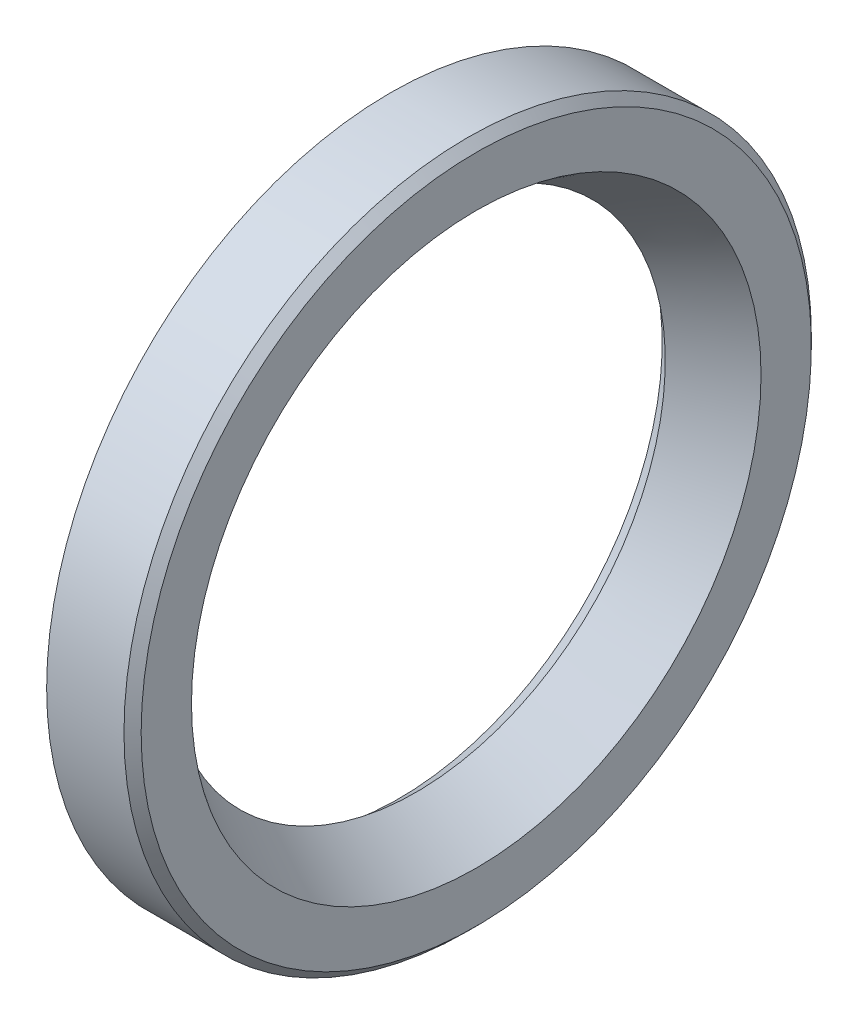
ISO-10303-21;
HEADER;
FILE_DESCRIPTION(('STEP AP214'),'2;1');
FILE_NAME('part.step','',(''),(''),'','','');
FILE_SCHEMA(('AUTOMOTIVE_DESIGN { 1 0 10303 214 1 1 1 1 }'));
ENDSEC;
DATA;
#1=APPLICATION_CONTEXT('core data for automotive mechanical design processes');
#2=APPLICATION_PROTOCOL_DEFINITION('international standard','automotive_design',2000,#1);
#3=PRODUCT_CONTEXT('',#1,'mechanical');
#4=PRODUCT('Part','Part','',(#3));
#5=PRODUCT_RELATED_PRODUCT_CATEGORY('part','',(#4));
#6=PRODUCT_DEFINITION_FORMATION('','',#4);
#7=PRODUCT_DEFINITION_CONTEXT('part definition',#1,'design');
#8=PRODUCT_DEFINITION('design','',#6,#7);
#9=PRODUCT_DEFINITION_SHAPE('','',#8);
#10=(LENGTH_UNIT() NAMED_UNIT(*) SI_UNIT(.MILLI.,.METRE.));
#11=(NAMED_UNIT(*) PLANE_ANGLE_UNIT() SI_UNIT($,.RADIAN.));
#12=(NAMED_UNIT(*) SI_UNIT($,.STERADIAN.) SOLID_ANGLE_UNIT());
#13=UNCERTAINTY_MEASURE_WITH_UNIT(LENGTH_MEASURE(1.E-05),#10,'distance_accuracy_value','');
#14=(GEOMETRIC_REPRESENTATION_CONTEXT(3) GLOBAL_UNCERTAINTY_ASSIGNED_CONTEXT((#13)) GLOBAL_UNIT_ASSIGNED_CONTEXT((#10,
#11,#12)) REPRESENTATION_CONTEXT('',''));
#15=CARTESIAN_POINT('',(0.,0.,0.));
#16=DIRECTION('',(0.,0.,1.));
#17=DIRECTION('',(1.,0.,0.));
#18=AXIS2_PLACEMENT_3D('',#15,#16,#17);
#19=CARTESIAN_POINT('',(5.66666666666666,0.,0.));
#20=DIRECTION('',(-1.,0.,0.));
#21=DIRECTION('',(0.,0.,1.));
#22=AXIS2_PLACEMENT_3D('',#19,#20,#21);
#23=TOROIDAL_SURFACE('',#22,37.2222222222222,1.);
#24=CARTESIAN_POINT('',(6.66666666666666,0.,0.));
#25=DIRECTION('',(-1.,0.,0.));
#26=DIRECTION('',(0.,0.,1.));
#27=AXIS2_PLACEMENT_3D('',#24,#25,#26);
#28=CIRCLE('',#27,37.2222222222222);
#29=CARTESIAN_POINT('',(6.66666666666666,0.,37.2222222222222));
#30=VERTEX_POINT('',#29);
#31=EDGE_CURVE('E10',#30,#30,#28,.T.);
#32=ORIENTED_EDGE('',*,*,#31,.F.);
#33=EDGE_LOOP('',(#32));
#34=FACE_BOUND('',#33,.T.);
#35=CARTESIAN_POINT('',(5.66666666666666,0.,0.));
#36=DIRECTION('',(-1.,0.,0.));
#37=DIRECTION('',(0.,0.,1.));
#38=AXIS2_PLACEMENT_3D('',#35,#36,#37);
#39=CIRCLE('',#38,38.2222222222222);
#40=CARTESIAN_POINT('',(5.66666666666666,0.,38.2222222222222));
#41=VERTEX_POINT('',#40);
#42=EDGE_CURVE('E76',#41,#41,#39,.T.);
#43=ORIENTED_EDGE('',*,*,#42,.T.);
#44=EDGE_LOOP('',(#43));
#45=FACE_BOUND('',#44,.T.);
#46=ADVANCED_FACE('F30',(#34,#45),#23,.F.);
#47=CARTESIAN_POINT('',(6.66666666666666,37.2222222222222,0.));
#48=DIRECTION('',(1.,0.,0.));
#49=DIRECTION('',(0.,0.,-1.));
#50=AXIS2_PLACEMENT_3D('',#47,#48,#49);
#51=PLANE('',#50);
#52=CARTESIAN_POINT('',(6.66666666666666,0.,0.));
#53=DIRECTION('',(-1.,0.,0.));
#54=DIRECTION('',(0.,0.,1.));
#55=AXIS2_PLACEMENT_3D('',#52,#53,#54);
#56=CIRCLE('',#55,33.1428571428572);
#57=CARTESIAN_POINT('',(6.66666666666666,0.,33.1428571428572));
#58=VERTEX_POINT('',#57);
#59=EDGE_CURVE('E36',#58,#58,#56,.T.);
#60=ORIENTED_EDGE('',*,*,#59,.F.);
#61=EDGE_LOOP('',(#60));
#62=FACE_BOUND('',#61,.T.);
#63=ORIENTED_EDGE('',*,*,#31,.T.);
#64=EDGE_LOOP('',(#63));
#65=FACE_BOUND('',#64,.T.);
#66=ADVANCED_FACE('F149',(#62,#65),#51,.F.);
#67=CARTESIAN_POINT('',(5.66666666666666,0.,0.));
#68=DIRECTION('',(-1.,0.,0.));
#69=DIRECTION('',(0.,0.,1.));
#70=AXIS2_PLACEMENT_3D('',#67,#68,#69);
#71=TOROIDAL_SURFACE('',#70,33.1428571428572,1.);
#72=CARTESIAN_POINT('',(5.66666666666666,0.,0.));
#73=DIRECTION('',(-1.,0.,0.));
#74=DIRECTION('',(0.,0.,1.));
#75=AXIS2_PLACEMENT_3D('',#72,#73,#74);
#76=CIRCLE('',#75,32.1428571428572);
#77=CARTESIAN_POINT('',(5.66666666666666,0.,32.1428571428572));
#78=VERTEX_POINT('',#77);
#79=EDGE_CURVE('E40',#78,#78,#76,.T.);
#80=ORIENTED_EDGE('',*,*,#79,.F.);
#81=EDGE_LOOP('',(#80));
#82=FACE_BOUND('',#81,.T.);
#83=ORIENTED_EDGE('',*,*,#59,.T.);
#84=EDGE_LOOP('',(#83));
#85=FACE_BOUND('',#84,.T.);
#86=ADVANCED_FACE('F144',(#82,#85),#71,.F.);
#87=CARTESIAN_POINT('',(-10.,0.,0.));
#88=DIRECTION('',(-1.,0.,0.));
#89=DIRECTION('',(0.,0.,1.));
#90=AXIS2_PLACEMENT_3D('',#87,#88,#89);
#91=CYLINDRICAL_SURFACE('',#90,32.1428571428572);
#92=CARTESIAN_POINT('',(3.,0.,0.));
#93=DIRECTION('',(-1.,0.,0.));
#94=DIRECTION('',(0.,0.,1.));
#95=AXIS2_PLACEMENT_3D('',#92,#93,#94);
#96=CIRCLE('',#95,32.1428571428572);
#97=CARTESIAN_POINT('',(3.,0.,32.1428571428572));
#98=VERTEX_POINT('',#97);
#99=EDGE_CURVE('E44',#98,#98,#96,.T.);
#100=ORIENTED_EDGE('',*,*,#99,.F.);
#101=EDGE_LOOP('',(#100));
#102=FACE_BOUND('',#101,.T.);
#103=ORIENTED_EDGE('',*,*,#79,.T.);
#104=EDGE_LOOP('',(#103));
#105=FACE_BOUND('',#104,.T.);
#106=ADVANCED_FACE('F138',(#102,#105),#91,.T.);
#107=CARTESIAN_POINT('',(3.,0.,0.));
#108=DIRECTION('',(-1.,0.,0.));
#109=DIRECTION('',(0.,0.,1.));
#110=AXIS2_PLACEMENT_3D('',#107,#108,#109);
#111=TOROIDAL_SURFACE('',#110,33.1428571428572,1.);
#112=CARTESIAN_POINT('',(2.,0.,0.));
#113=DIRECTION('',(-1.,0.,0.));
#114=DIRECTION('',(0.,0.,1.));
#115=AXIS2_PLACEMENT_3D('',#112,#113,#114);
#116=CIRCLE('',#115,33.1428571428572);
#117=CARTESIAN_POINT('',(2.,0.,33.1428571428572));
#118=VERTEX_POINT('',#117);
#119=EDGE_CURVE('E49',#118,#118,#116,.T.);
#120=ORIENTED_EDGE('',*,*,#119,.F.);
#121=EDGE_LOOP('',(#120));
#122=FACE_BOUND('',#121,.T.);
#123=ORIENTED_EDGE('',*,*,#99,.T.);
#124=EDGE_LOOP('',(#123));
#125=FACE_BOUND('',#124,.T.);
#126=ADVANCED_FACE('F132',(#122,#125),#111,.T.);
#127=CARTESIAN_POINT('',(-10.,0.,0.));
#128=DIRECTION('',(-1.,0.,0.));
#129=DIRECTION('',(0.,0.,1.));
#130=AXIS2_PLACEMENT_3D('',#127,#128,#129);
#131=CYLINDRICAL_SURFACE('',#130,33.1428571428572);
#132=CARTESIAN_POINT('',(0.999999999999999,0.,0.));
#133=DIRECTION('',(-1.,0.,0.));
#134=DIRECTION('',(0.,0.,1.));
#135=AXIS2_PLACEMENT_3D('',#132,#133,#134);
#136=CIRCLE('',#135,33.1428571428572);
#137=CARTESIAN_POINT('',(0.999999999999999,0.,33.1428571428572));
#138=VERTEX_POINT('',#137);
#139=EDGE_CURVE('E52',#138,#138,#136,.T.);
#140=ORIENTED_EDGE('',*,*,#139,.F.);
#141=EDGE_LOOP('',(#140));
#142=FACE_BOUND('',#141,.T.);
#143=ORIENTED_EDGE('',*,*,#119,.T.);
#144=EDGE_LOOP('',(#143));
#145=FACE_BOUND('',#144,.T.);
#146=ADVANCED_FACE('F126',(#142,#145),#131,.T.);
#147=CARTESIAN_POINT('',(1.,33.1428571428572,0.));
#148=DIRECTION('',(1.,0.,0.));
#149=DIRECTION('',(0.,0.,-1.));
#150=AXIS2_PLACEMENT_3D('',#147,#148,#149);
#151=PLANE('',#150);
#152=CARTESIAN_POINT('',(0.999999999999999,0.,0.));
#153=DIRECTION('',(-1.,0.,0.));
#154=DIRECTION('',(0.,0.,1.));
#155=AXIS2_PLACEMENT_3D('',#152,#153,#154);
#156=CIRCLE('',#155,30.6417311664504);
#157=CARTESIAN_POINT('',(0.999999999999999,0.,30.6417311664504));
#158=VERTEX_POINT('',#157);
#159=EDGE_CURVE('E55',#158,#158,#156,.T.);
#160=ORIENTED_EDGE('',*,*,#159,.F.);
#161=EDGE_LOOP('',(#160));
#162=FACE_BOUND('',#161,.T.);
#163=ORIENTED_EDGE('',*,*,#139,.T.);
#164=EDGE_LOOP('',(#163));
#165=FACE_BOUND('',#164,.T.);
#166=ADVANCED_FACE('F120',(#162,#165),#151,.F.);
#167=CARTESIAN_POINT('',(0.999999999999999,0.,0.));
#168=DIRECTION('',(-1.,0.,0.));
#169=DIRECTION('',(0.,0.,1.));
#170=AXIS2_PLACEMENT_3D('',#167,#168,#169);
#171=CONICAL_SURFACE('',#170,30.6417311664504,0.687334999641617);
#172=CARTESIAN_POINT('',(3.,0.,0.));
#173=DIRECTION('',(-1.,0.,0.));
#174=DIRECTION('',(0.,0.,1.));
#175=AXIS2_PLACEMENT_3D('',#172,#173,#174);
#176=CIRCLE('',#175,29.);
#177=CARTESIAN_POINT('',(3.,0.,29.));
#178=VERTEX_POINT('',#177);
#179=EDGE_CURVE('E58',#178,#178,#176,.T.);
#180=ORIENTED_EDGE('',*,*,#179,.F.);
#181=EDGE_LOOP('',(#180));
#182=FACE_BOUND('',#181,.T.);
#183=ORIENTED_EDGE('',*,*,#159,.T.);
#184=EDGE_LOOP('',(#183));
#185=FACE_BOUND('',#184,.T.);
#186=ADVANCED_FACE('F114',(#182,#185),#171,.F.);
#187=CARTESIAN_POINT('',(3.,0.,0.));
#188=DIRECTION('',(1.,0.,0.));
#189=DIRECTION('',(0.,0.,-1.));
#190=AXIS2_PLACEMENT_3D('',#187,#188,#189);
#191=CONICAL_SURFACE('',#190,29.,0.534395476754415);
#192=CARTESIAN_POINT('',(10.,0.,0.));
#193=DIRECTION('',(-1.,0.,0.));
#194=DIRECTION('',(0.,0.,1.));
#195=AXIS2_PLACEMENT_3D('',#192,#193,#194);
#196=CIRCLE('',#195,33.1428571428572);
#197=CARTESIAN_POINT('',(10.,0.,33.1428571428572));
#198=VERTEX_POINT('',#197);
#199=EDGE_CURVE('E61',#198,#198,#196,.T.);
#200=ORIENTED_EDGE('',*,*,#199,.F.);
#201=EDGE_LOOP('',(#200));
#202=FACE_BOUND('',#201,.T.);
#203=ORIENTED_EDGE('',*,*,#179,.T.);
#204=EDGE_LOOP('',(#203));
#205=FACE_BOUND('',#204,.T.);
#206=ADVANCED_FACE('F108',(#202,#205),#191,.F.);
#207=CARTESIAN_POINT('',(9.99999999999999,33.1428571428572,0.));
#208=DIRECTION('',(-1.,0.,0.));
#209=DIRECTION('',(0.,0.,1.));
#210=AXIS2_PLACEMENT_3D('',#207,#208,#209);
#211=PLANE('',#210);
#212=CARTESIAN_POINT('',(9.99999999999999,0.,0.));
#213=DIRECTION('',(-1.,0.,0.));
#214=DIRECTION('',(0.,0.,1.));
#215=AXIS2_PLACEMENT_3D('',#212,#213,#214);
#216=CIRCLE('',#215,39.);
#217=CARTESIAN_POINT('',(9.99999999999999,0.,39.));
#218=VERTEX_POINT('',#217);
#219=EDGE_CURVE('E64',#218,#218,#216,.T.);
#220=ORIENTED_EDGE('',*,*,#219,.F.);
#221=EDGE_LOOP('',(#220));
#222=FACE_BOUND('',#221,.T.);
#223=ORIENTED_EDGE('',*,*,#199,.T.);
#224=EDGE_LOOP('',(#223));
#225=FACE_BOUND('',#224,.T.);
#226=ADVANCED_FACE('F102',(#222,#225),#211,.F.);
#227=CARTESIAN_POINT('',(9.99999999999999,0.,0.));
#228=DIRECTION('',(-1.,0.,0.));
#229=DIRECTION('',(0.,0.,1.));
#230=AXIS2_PLACEMENT_3D('',#227,#228,#229);
#231=CONICAL_SURFACE('',#230,39.,0.78539816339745);
#232=CARTESIAN_POINT('',(9.,0.,0.));
#233=DIRECTION('',(-1.,0.,0.));
#234=DIRECTION('',(0.,0.,1.));
#235=AXIS2_PLACEMENT_3D('',#232,#233,#234);
#236=CIRCLE('',#235,40.);
#237=CARTESIAN_POINT('',(9.,0.,40.));
#238=VERTEX_POINT('',#237);
#239=EDGE_CURVE('E67',#238,#238,#236,.T.);
#240=ORIENTED_EDGE('',*,*,#239,.F.);
#241=EDGE_LOOP('',(#240));
#242=FACE_BOUND('',#241,.T.);
#243=ORIENTED_EDGE('',*,*,#219,.T.);
#244=EDGE_LOOP('',(#243));
#245=FACE_BOUND('',#244,.T.);
#246=ADVANCED_FACE('F96',(#242,#245),#231,.T.);
#247=CARTESIAN_POINT('',(-10.,0.,0.));
#248=DIRECTION('',(-1.,0.,0.));
#249=DIRECTION('',(0.,0.,1.));
#250=AXIS2_PLACEMENT_3D('',#247,#248,#249);
#251=CYLINDRICAL_SURFACE('',#250,40.);
#252=CARTESIAN_POINT('',(0.,0.,0.));
#253=DIRECTION('',(-1.,0.,0.));
#254=DIRECTION('',(0.,0.,1.));
#255=AXIS2_PLACEMENT_3D('',#252,#253,#254);
#256=CIRCLE('',#255,40.);
#257=CARTESIAN_POINT('',(0.,0.,40.));
#258=VERTEX_POINT('',#257);
#259=EDGE_CURVE('E70',#258,#258,#256,.T.);
#260=ORIENTED_EDGE('',*,*,#259,.F.);
#261=EDGE_LOOP('',(#260));
#262=FACE_BOUND('',#261,.T.);
#263=ORIENTED_EDGE('',*,*,#239,.T.);
#264=EDGE_LOOP('',(#263));
#265=FACE_BOUND('',#264,.T.);
#266=ADVANCED_FACE('F90',(#262,#265),#251,.T.);
#267=CARTESIAN_POINT('',(0.,38.2222222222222,0.));
#268=DIRECTION('',(1.,0.,0.));
#269=DIRECTION('',(0.,0.,-1.));
#270=AXIS2_PLACEMENT_3D('',#267,#268,#269);
#271=PLANE('',#270);
#272=CARTESIAN_POINT('',(0.,0.,0.));
#273=DIRECTION('',(-1.,0.,0.));
#274=DIRECTION('',(0.,0.,1.));
#275=AXIS2_PLACEMENT_3D('',#272,#273,#274);
#276=CIRCLE('',#275,38.2222222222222);
#277=CARTESIAN_POINT('',(0.,0.,38.2222222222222));
#278=VERTEX_POINT('',#277);
#279=EDGE_CURVE('E73',#278,#278,#276,.T.);
#280=ORIENTED_EDGE('',*,*,#279,.F.);
#281=EDGE_LOOP('',(#280));
#282=FACE_BOUND('',#281,.T.);
#283=ORIENTED_EDGE('',*,*,#259,.T.);
#284=EDGE_LOOP('',(#283));
#285=FACE_BOUND('',#284,.T.);
#286=ADVANCED_FACE('F84',(#282,#285),#271,.F.);
#287=CARTESIAN_POINT('',(-10.,0.,0.));
#288=DIRECTION('',(-1.,0.,0.));
#289=DIRECTION('',(0.,0.,1.));
#290=AXIS2_PLACEMENT_3D('',#287,#288,#289);
#291=CYLINDRICAL_SURFACE('',#290,38.2222222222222);
#292=ORIENTED_EDGE('',*,*,#42,.F.);
#293=EDGE_LOOP('',(#292));
#294=FACE_BOUND('',#293,.T.);
#295=ORIENTED_EDGE('',*,*,#279,.T.);
#296=EDGE_LOOP('',(#295));
#297=FACE_BOUND('',#296,.T.);
#298=ADVANCED_FACE('F81',(#294,#297),#291,.F.);
#299=CLOSED_SHELL('',(#46,#66,#86,#106,#126,#146,#166,#186,#206,#226,#246,#266,#286,#298));
#300=MANIFOLD_SOLID_BREP('B2',#299);
#301=ADVANCED_BREP_SHAPE_REPRESENTATION('',(#18,#300),#14);
#302=SHAPE_DEFINITION_REPRESENTATION(#9,#301);
ENDSEC;
END-ISO-10303-21;
